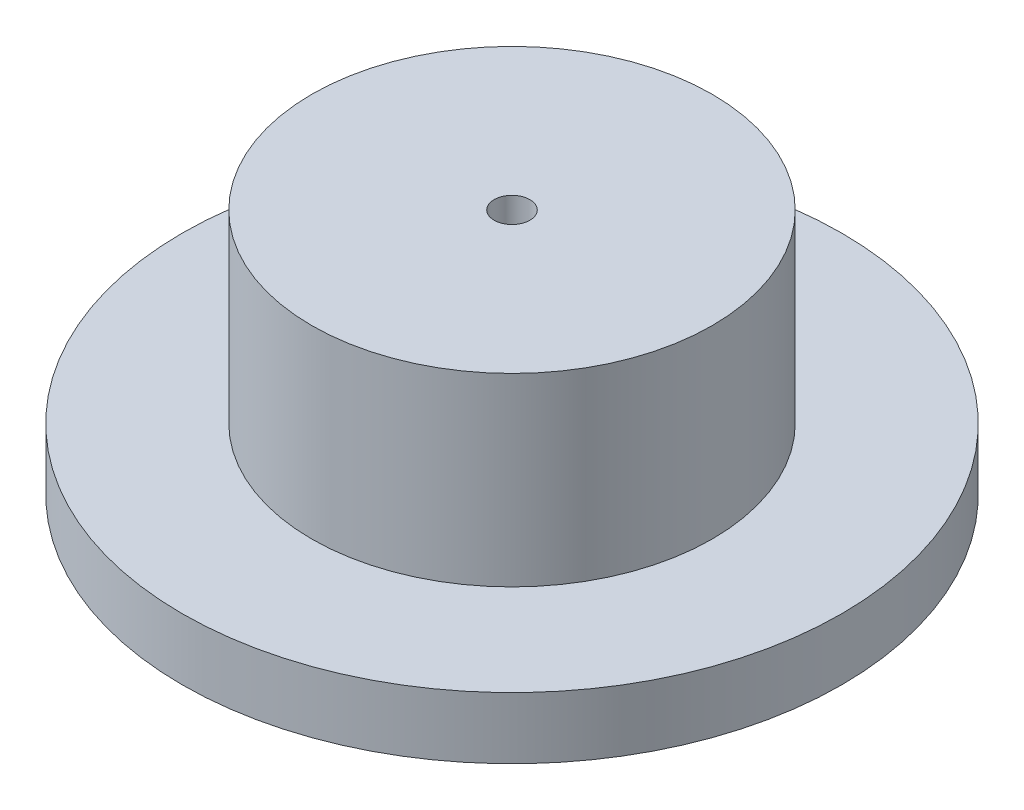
ISO-10303-21;
HEADER;
FILE_DESCRIPTION(('STEP AP214'),'2;1');
FILE_NAME('part.step','',(''),(''),'','','');
FILE_SCHEMA(('AUTOMOTIVE_DESIGN { 1 0 10303 214 1 1 1 1 }'));
ENDSEC;
DATA;
#1=APPLICATION_CONTEXT('core data for automotive mechanical design processes');
#2=APPLICATION_PROTOCOL_DEFINITION('international standard','automotive_design',2000,#1);
#3=PRODUCT_CONTEXT('',#1,'mechanical');
#4=PRODUCT('Part','Part','',(#3));
#5=PRODUCT_RELATED_PRODUCT_CATEGORY('part','',(#4));
#6=PRODUCT_DEFINITION_FORMATION('','',#4);
#7=PRODUCT_DEFINITION_CONTEXT('part definition',#1,'design');
#8=PRODUCT_DEFINITION('design','',#6,#7);
#9=PRODUCT_DEFINITION_SHAPE('','',#8);
#10=(LENGTH_UNIT() NAMED_UNIT(*) SI_UNIT(.MILLI.,.METRE.));
#11=(NAMED_UNIT(*) PLANE_ANGLE_UNIT() SI_UNIT($,.RADIAN.));
#12=(NAMED_UNIT(*) SI_UNIT($,.STERADIAN.) SOLID_ANGLE_UNIT());
#13=UNCERTAINTY_MEASURE_WITH_UNIT(LENGTH_MEASURE(1.E-05),#10,'distance_accuracy_value','');
#14=(GEOMETRIC_REPRESENTATION_CONTEXT(3) GLOBAL_UNCERTAINTY_ASSIGNED_CONTEXT((#13)) GLOBAL_UNIT_ASSIGNED_CONTEXT((#10,
#11,#12)) REPRESENTATION_CONTEXT('',''));
#15=CARTESIAN_POINT('',(0.,0.,0.));
#16=DIRECTION('',(0.,0.,1.));
#17=DIRECTION('',(1.,0.,0.));
#18=AXIS2_PLACEMENT_3D('',#15,#16,#17);
#19=CARTESIAN_POINT('',(0.,5.,0.));
#20=DIRECTION('',(0.,-1.,0.));
#21=DIRECTION('',(0.,0.,-1.));
#22=AXIS2_PLACEMENT_3D('',#19,#20,#21);
#23=CYLINDRICAL_SURFACE('',#22,26.75);
#24=CARTESIAN_POINT('',(0.,5.,0.));
#25=DIRECTION('',(0.,1.,0.));
#26=DIRECTION('',(0.,0.,1.));
#27=AXIS2_PLACEMENT_3D('',#24,#25,#26);
#28=CIRCLE('',#27,26.75);
#29=CARTESIAN_POINT('',(0.,5.,26.75));
#30=VERTEX_POINT('',#29);
#31=EDGE_CURVE('E51',#30,#30,#28,.T.);
#32=ORIENTED_EDGE('',*,*,#31,.F.);
#33=EDGE_LOOP('',(#32));
#34=FACE_BOUND('',#33,.T.);
#35=CARTESIAN_POINT('',(0.,0.,0.));
#36=DIRECTION('',(0.,1.,0.));
#37=DIRECTION('',(0.,0.,1.));
#38=AXIS2_PLACEMENT_3D('',#35,#36,#37);
#39=CIRCLE('',#38,26.75);
#40=CARTESIAN_POINT('',(0.,0.,26.75));
#41=VERTEX_POINT('',#40);
#42=EDGE_CURVE('E46',#41,#41,#39,.T.);
#43=ORIENTED_EDGE('',*,*,#42,.T.);
#44=EDGE_LOOP('',(#43));
#45=FACE_BOUND('',#44,.T.);
#46=ADVANCED_FACE('F43',(#34,#45),#23,.T.);
#47=CARTESIAN_POINT('',(0.,0.,0.));
#48=DIRECTION('',(0.,1.,0.));
#49=DIRECTION('',(0.,0.,1.));
#50=AXIS2_PLACEMENT_3D('',#47,#48,#49);
#51=PLANE('',#50);
#52=ORIENTED_EDGE('',*,*,#42,.F.);
#53=EDGE_LOOP('',(#52));
#54=FACE_BOUND('',#53,.T.);
#55=ADVANCED_FACE('F86',(#54),#51,.F.);
#56=CARTESIAN_POINT('',(0.,5.,0.));
#57=DIRECTION('',(0.,1.,0.));
#58=DIRECTION('',(0.,0.,1.));
#59=AXIS2_PLACEMENT_3D('',#56,#57,#58);
#60=PLANE('',#59);
#61=CARTESIAN_POINT('',(0.,5.,0.));
#62=DIRECTION('',(0.,1.,0.));
#63=DIRECTION('',(0.,0.,1.));
#64=AXIS2_PLACEMENT_3D('',#61,#62,#63);
#65=CIRCLE('',#64,16.25);
#66=CARTESIAN_POINT('',(0.,5.,16.25));
#67=VERTEX_POINT('',#66);
#68=EDGE_CURVE('E11',#67,#67,#65,.T.);
#69=ORIENTED_EDGE('',*,*,#68,.F.);
#70=EDGE_LOOP('',(#69));
#71=FACE_BOUND('',#70,.T.);
#72=ORIENTED_EDGE('',*,*,#31,.T.);
#73=EDGE_LOOP('',(#72));
#74=FACE_BOUND('',#73,.T.);
#75=ADVANCED_FACE('F77',(#71,#74),#60,.T.);
#76=CARTESIAN_POINT('',(0.,20.,0.));
#77=DIRECTION('',(0.,1.,0.));
#78=DIRECTION('',(0.,0.,1.));
#79=AXIS2_PLACEMENT_3D('',#76,#77,#78);
#80=PLANE('',#79);
#81=CARTESIAN_POINT('',(0.,20.,0.));
#82=DIRECTION('',(0.,1.,0.));
#83=DIRECTION('',(0.,0.,1.));
#84=AXIS2_PLACEMENT_3D('',#81,#82,#83);
#85=CIRCLE('',#84,16.25);
#86=CARTESIAN_POINT('',(0.,20.,16.25));
#87=VERTEX_POINT('',#86);
#88=EDGE_CURVE('E58',#87,#87,#85,.T.);
#89=ORIENTED_EDGE('',*,*,#88,.T.);
#90=EDGE_LOOP('',(#89));
#91=FACE_BOUND('',#90,.T.);
#92=CARTESIAN_POINT('',(0.,20.,0.));
#93=DIRECTION('',(0.,1.,0.));
#94=DIRECTION('',(0.,0.,1.));
#95=AXIS2_PLACEMENT_3D('',#92,#93,#94);
#96=CIRCLE('',#95,1.45148584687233);
#97=CARTESIAN_POINT('',(0.,20.,1.45148584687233));
#98=VERTEX_POINT('',#97);
#99=EDGE_CURVE('E62',#98,#98,#96,.T.);
#100=ORIENTED_EDGE('',*,*,#99,.F.);
#101=EDGE_LOOP('',(#100));
#102=FACE_BOUND('',#101,.T.);
#103=ADVANCED_FACE('F74',(#91,#102),#80,.T.);
#104=CARTESIAN_POINT('',(0.,20.,0.));
#105=DIRECTION('',(0.,-1.,0.));
#106=DIRECTION('',(0.,0.,-1.));
#107=AXIS2_PLACEMENT_3D('',#104,#105,#106);
#108=CYLINDRICAL_SURFACE('',#107,16.25);
#109=ORIENTED_EDGE('',*,*,#88,.F.);
#110=EDGE_LOOP('',(#109));
#111=FACE_BOUND('',#110,.T.);
#112=ORIENTED_EDGE('',*,*,#68,.T.);
#113=EDGE_LOOP('',(#112));
#114=FACE_BOUND('',#113,.T.);
#115=ADVANCED_FACE('F76',(#111,#114),#108,.T.);
#116=CARTESIAN_POINT('',(0.,20.,0.));
#117=DIRECTION('',(0.,-1.,0.));
#118=DIRECTION('',(0.,0.,-1.));
#119=AXIS2_PLACEMENT_3D('',#116,#117,#118);
#120=CYLINDRICAL_SURFACE('',#119,1.45148584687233);
#121=ORIENTED_EDGE('',*,*,#99,.T.);
#122=EDGE_LOOP('',(#121));
#123=FACE_BOUND('',#122,.T.);
#124=CARTESIAN_POINT('',(0.,5.,0.));
#125=DIRECTION('',(0.,1.,0.));
#126=DIRECTION('',(0.,0.,1.));
#127=AXIS2_PLACEMENT_3D('',#124,#125,#126);
#128=CIRCLE('',#127,1.45148584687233);
#129=CARTESIAN_POINT('',(0.,5.,1.45148584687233));
#130=VERTEX_POINT('',#129);
#131=EDGE_CURVE('E63',#130,#130,#128,.T.);
#132=ORIENTED_EDGE('',*,*,#131,.F.);
#133=EDGE_LOOP('',(#132));
#134=FACE_BOUND('',#133,.T.);
#135=ADVANCED_FACE('F71',(#123,#134),#120,.F.);
#136=ORIENTED_EDGE('',*,*,#131,.T.);
#137=EDGE_LOOP('',(#136));
#138=FACE_BOUND('',#137,.T.);
#139=ADVANCED_FACE('F89',(#138),#60,.T.);
#140=CLOSED_SHELL('',(#46,#55,#75,#103,#115,#135,#139));
#141=MANIFOLD_SOLID_BREP('B2',#140);
#142=ADVANCED_BREP_SHAPE_REPRESENTATION('',(#18,#141),#14);
#143=SHAPE_DEFINITION_REPRESENTATION(#9,#142);
ENDSEC;
END-ISO-10303-21;
